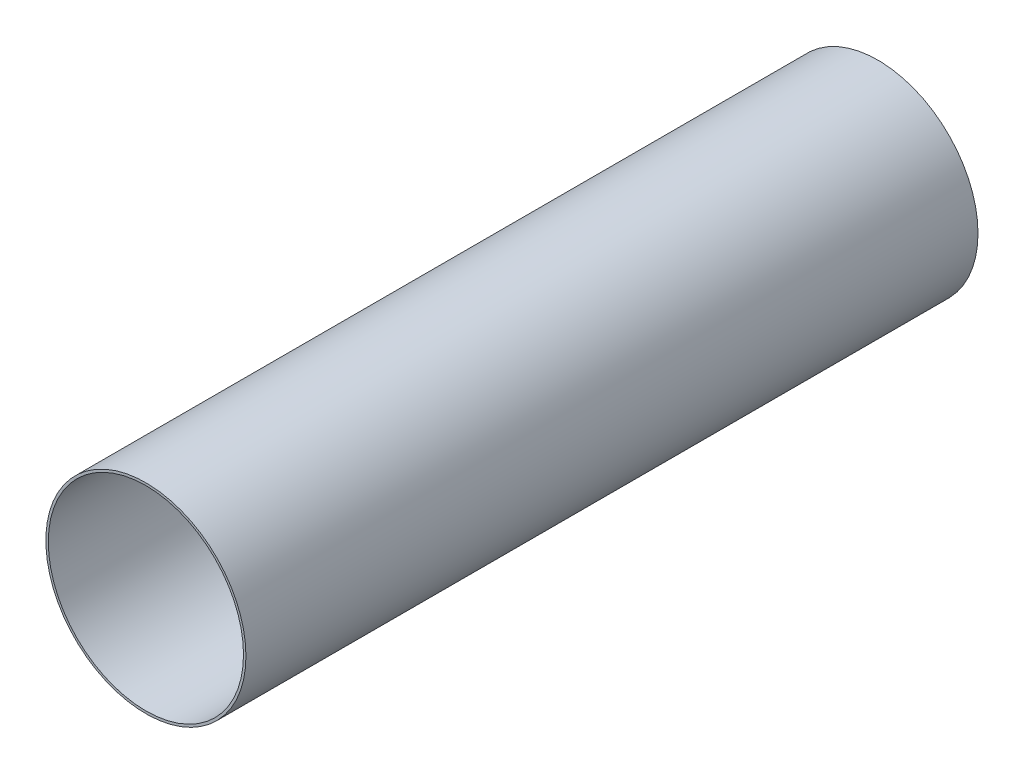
ISO-10303-21;
HEADER;
FILE_DESCRIPTION(('STEP AP214'),'2;1');
FILE_NAME('part.step','',(''),(''),'','','');
FILE_SCHEMA(('AUTOMOTIVE_DESIGN { 1 0 10303 214 1 1 1 1 }'));
ENDSEC;
DATA;
#1=APPLICATION_CONTEXT('core data for automotive mechanical design processes');
#2=APPLICATION_PROTOCOL_DEFINITION('international standard','automotive_design',2000,#1);
#3=PRODUCT_CONTEXT('',#1,'mechanical');
#4=PRODUCT('Part','Part','',(#3));
#5=PRODUCT_RELATED_PRODUCT_CATEGORY('part','',(#4));
#6=PRODUCT_DEFINITION_FORMATION('','',#4);
#7=PRODUCT_DEFINITION_CONTEXT('part definition',#1,'design');
#8=PRODUCT_DEFINITION('design','',#6,#7);
#9=PRODUCT_DEFINITION_SHAPE('','',#8);
#10=(LENGTH_UNIT() NAMED_UNIT(*) SI_UNIT(.MILLI.,.METRE.));
#11=(NAMED_UNIT(*) PLANE_ANGLE_UNIT() SI_UNIT($,.RADIAN.));
#12=(NAMED_UNIT(*) SI_UNIT($,.STERADIAN.) SOLID_ANGLE_UNIT());
#13=UNCERTAINTY_MEASURE_WITH_UNIT(LENGTH_MEASURE(1.E-05),#10,'distance_accuracy_value','');
#14=(GEOMETRIC_REPRESENTATION_CONTEXT(3) GLOBAL_UNCERTAINTY_ASSIGNED_CONTEXT((#13)) GLOBAL_UNIT_ASSIGNED_CONTEXT((#10,
#11,#12)) REPRESENTATION_CONTEXT('',''));
#15=CARTESIAN_POINT('',(0.,0.,0.));
#16=DIRECTION('',(0.,0.,1.));
#17=DIRECTION('',(1.,0.,0.));
#18=AXIS2_PLACEMENT_3D('',#15,#16,#17);
#19=CARTESIAN_POINT('',(0.,0.,300.));
#20=DIRECTION('',(0.,0.,1.));
#21=DIRECTION('',(1.,0.,0.));
#22=AXIS2_PLACEMENT_3D('',#19,#20,#21);
#23=PLANE('',#22);
#24=CARTESIAN_POINT('',(0.,0.,300.));
#25=DIRECTION('',(0.,0.,1.));
#26=DIRECTION('',(1.,0.,0.));
#27=AXIS2_PLACEMENT_3D('',#24,#25,#26);
#28=CIRCLE('',#27,82.);
#29=CARTESIAN_POINT('',(82.,0.,300.));
#30=VERTEX_POINT('',#29);
#31=EDGE_CURVE('E10',#30,#30,#28,.T.);
#32=ORIENTED_EDGE('',*,*,#31,.T.);
#33=EDGE_LOOP('',(#32));
#34=FACE_BOUND('',#33,.T.);
#35=CARTESIAN_POINT('',(0.,0.,300.));
#36=DIRECTION('',(0.,0.,1.));
#37=DIRECTION('',(1.,0.,0.));
#38=AXIS2_PLACEMENT_3D('',#35,#36,#37);
#39=CIRCLE('',#38,80.);
#40=CARTESIAN_POINT('',(80.,0.,300.));
#41=VERTEX_POINT('',#40);
#42=EDGE_CURVE('E44',#41,#41,#39,.T.);
#43=ORIENTED_EDGE('',*,*,#42,.F.);
#44=EDGE_LOOP('',(#43));
#45=FACE_BOUND('',#44,.T.);
#46=ADVANCED_FACE('F33',(#34,#45),#23,.T.);
#47=CARTESIAN_POINT('',(0.,0.,-300.));
#48=DIRECTION('',(0.,0.,1.));
#49=DIRECTION('',(1.,0.,0.));
#50=AXIS2_PLACEMENT_3D('',#47,#48,#49);
#51=PLANE('',#50);
#52=CARTESIAN_POINT('',(0.,0.,-300.));
#53=DIRECTION('',(0.,0.,1.));
#54=DIRECTION('',(1.,0.,0.));
#55=AXIS2_PLACEMENT_3D('',#52,#53,#54);
#56=CIRCLE('',#55,82.);
#57=CARTESIAN_POINT('',(82.,0.,-300.));
#58=VERTEX_POINT('',#57);
#59=EDGE_CURVE('E37',#58,#58,#56,.T.);
#60=ORIENTED_EDGE('',*,*,#59,.F.);
#61=EDGE_LOOP('',(#60));
#62=FACE_BOUND('',#61,.T.);
#63=CARTESIAN_POINT('',(0.,0.,-300.));
#64=DIRECTION('',(0.,0.,1.));
#65=DIRECTION('',(1.,0.,0.));
#66=AXIS2_PLACEMENT_3D('',#63,#64,#65);
#67=CIRCLE('',#66,80.);
#68=CARTESIAN_POINT('',(80.,0.,-300.));
#69=VERTEX_POINT('',#68);
#70=EDGE_CURVE('E46',#69,#69,#67,.T.);
#71=ORIENTED_EDGE('',*,*,#70,.T.);
#72=EDGE_LOOP('',(#71));
#73=FACE_BOUND('',#72,.T.);
#74=ADVANCED_FACE('F56',(#62,#73),#51,.F.);
#75=CARTESIAN_POINT('',(0.,0.,300.));
#76=DIRECTION('',(0.,0.,-1.));
#77=DIRECTION('',(-1.,0.,0.));
#78=AXIS2_PLACEMENT_3D('',#75,#76,#77);
#79=CYLINDRICAL_SURFACE('',#78,82.);
#80=ORIENTED_EDGE('',*,*,#31,.F.);
#81=EDGE_LOOP('',(#80));
#82=FACE_BOUND('',#81,.T.);
#83=ORIENTED_EDGE('',*,*,#59,.T.);
#84=EDGE_LOOP('',(#83));
#85=FACE_BOUND('',#84,.T.);
#86=ADVANCED_FACE('F35',(#82,#85),#79,.T.);
#87=CARTESIAN_POINT('',(0.,0.,300.));
#88=DIRECTION('',(0.,0.,-1.));
#89=DIRECTION('',(-1.,0.,0.));
#90=AXIS2_PLACEMENT_3D('',#87,#88,#89);
#91=CYLINDRICAL_SURFACE('',#90,80.);
#92=ORIENTED_EDGE('',*,*,#42,.T.);
#93=EDGE_LOOP('',(#92));
#94=FACE_BOUND('',#93,.T.);
#95=ORIENTED_EDGE('',*,*,#70,.F.);
#96=EDGE_LOOP('',(#95));
#97=FACE_BOUND('',#96,.T.);
#98=ADVANCED_FACE('F52',(#94,#97),#91,.F.);
#99=CLOSED_SHELL('',(#46,#74,#86,#98));
#100=MANIFOLD_SOLID_BREP('B2',#99);
#101=ADVANCED_BREP_SHAPE_REPRESENTATION('',(#18,#100),#14);
#102=SHAPE_DEFINITION_REPRESENTATION(#9,#101);
ENDSEC;
END-ISO-10303-21;
